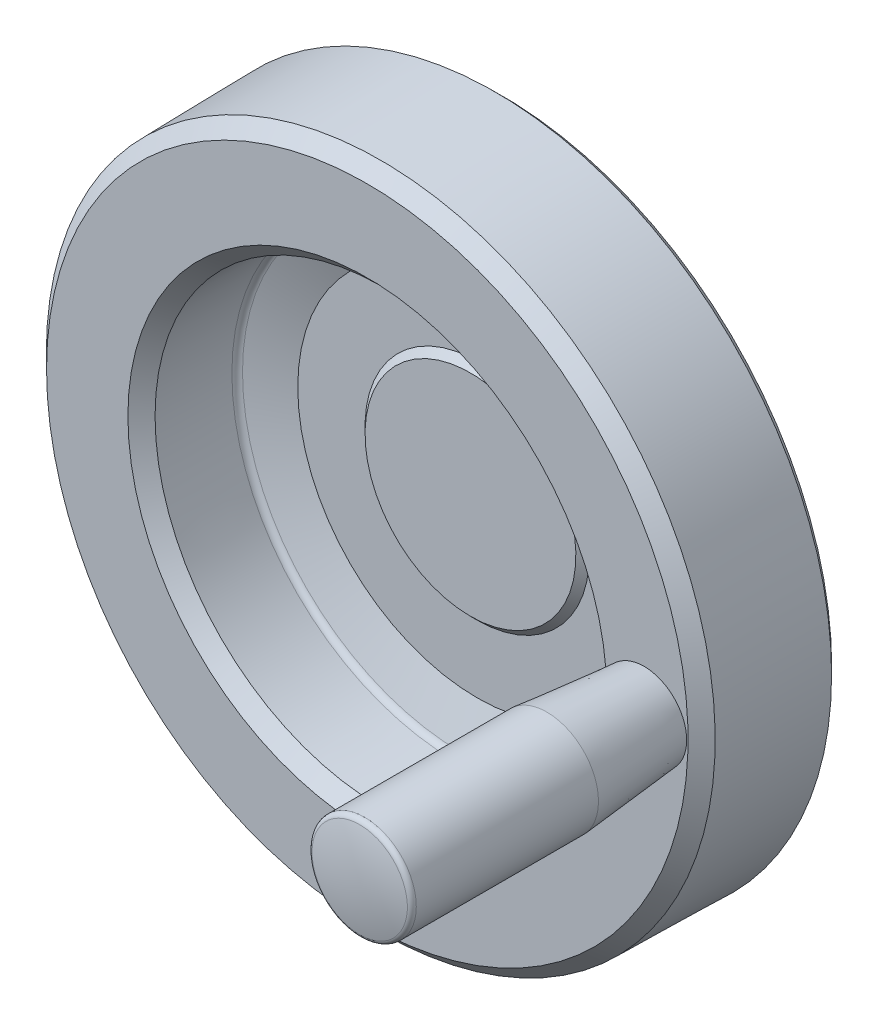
ISO-10303-21;
HEADER;
FILE_DESCRIPTION(('STEP AP214'),'2;1');
FILE_NAME('part.step','',(''),(''),'','','');
FILE_SCHEMA(('AUTOMOTIVE_DESIGN { 1 0 10303 214 1 1 1 1 }'));
ENDSEC;
DATA;
#1=APPLICATION_CONTEXT('core data for automotive mechanical design processes');
#2=APPLICATION_PROTOCOL_DEFINITION('international standard','automotive_design',2000,#1);
#3=PRODUCT_CONTEXT('',#1,'mechanical');
#4=PRODUCT('Part','Part','',(#3));
#5=PRODUCT_RELATED_PRODUCT_CATEGORY('part','',(#4));
#6=PRODUCT_DEFINITION_FORMATION('','',#4);
#7=PRODUCT_DEFINITION_CONTEXT('part definition',#1,'design');
#8=PRODUCT_DEFINITION('design','',#6,#7);
#9=PRODUCT_DEFINITION_SHAPE('','',#8);
#10=(LENGTH_UNIT() NAMED_UNIT(*) SI_UNIT(.MILLI.,.METRE.));
#11=(NAMED_UNIT(*) PLANE_ANGLE_UNIT() SI_UNIT($,.RADIAN.));
#12=(NAMED_UNIT(*) SI_UNIT($,.STERADIAN.) SOLID_ANGLE_UNIT());
#13=UNCERTAINTY_MEASURE_WITH_UNIT(LENGTH_MEASURE(1.E-05),#10,'distance_accuracy_value','');
#14=(GEOMETRIC_REPRESENTATION_CONTEXT(3) GLOBAL_UNCERTAINTY_ASSIGNED_CONTEXT((#13)) GLOBAL_UNIT_ASSIGNED_CONTEXT((#10,
#11,#12)) REPRESENTATION_CONTEXT('',''));
#15=CARTESIAN_POINT('',(0.,0.,0.));
#16=DIRECTION('',(0.,0.,1.));
#17=DIRECTION('',(1.,0.,0.));
#18=AXIS2_PLACEMENT_3D('',#15,#16,#17);
#19=CARTESIAN_POINT('',(62.,0.,46.7669999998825));
#20=DIRECTION('',(0.,0.,1.));
#21=DIRECTION('',(0.,-1.,0.));
#22=AXIS2_PLACEMENT_3D('',#19,#20,#21);
#23=CONICAL_SURFACE('',#22,3.99999999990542,0.785398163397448);
#24=CARTESIAN_POINT('',(62.,0.,46.));
#25=DIRECTION('',(0.,0.,1.));
#26=DIRECTION('',(0.,-1.,0.));
#27=AXIS2_PLACEMENT_3D('',#24,#25,#26);
#28=CIRCLE('',#27,3.23300000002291);
#29=CARTESIAN_POINT('',(62.,-3.23300000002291,46.));
#30=VERTEX_POINT('',#29);
#31=EDGE_CURVE('E132',#30,#30,#28,.T.);
#32=ORIENTED_EDGE('',*,*,#31,.T.);
#33=EDGE_LOOP('',(#32));
#34=FACE_BOUND('',#33,.T.);
#35=CARTESIAN_POINT('',(62.,0.,46.0904999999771));
#36=DIRECTION('',(0.,0.,1.));
#37=DIRECTION('',(0.,1.,0.));
#38=AXIS2_PLACEMENT_3D('',#35,#36,#37);
#39=CIRCLE('',#38,3.3235);
#40=CARTESIAN_POINT('',(62.,3.3235,46.0904999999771));
#41=VERTEX_POINT('',#40);
#42=EDGE_CURVE('E9',#41,#41,#39,.T.);
#43=ORIENTED_EDGE('',*,*,#42,.F.);
#44=EDGE_LOOP('',(#43));
#45=FACE_BOUND('',#44,.T.);
#46=ADVANCED_FACE('F15',(#34,#45),#23,.T.);
#47=CARTESIAN_POINT('',(62.,0.,46.));
#48=DIRECTION('',(0.,0.,1.));
#49=DIRECTION('',(-1.,0.,0.));
#50=AXIS2_PLACEMENT_3D('',#47,#48,#49);
#51=PLANE('',#50);
#52=DIRECTION('',(0.866025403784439,-0.5,0.));
#53=VECTOR('',#52,1.);
#54=CARTESIAN_POINT('',(62.,2.3094010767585,46.));
#55=LINE('',#54,#53);
#56=CARTESIAN_POINT('',(62.,2.3094010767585,46.));
#57=VERTEX_POINT('',#56);
#58=CARTESIAN_POINT('',(64.,1.15470053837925,46.));
#59=VERTEX_POINT('',#58);
#60=EDGE_CURVE('E35',#57,#59,#55,.T.);
#61=ORIENTED_EDGE('',*,*,#60,.F.);
#62=DIRECTION('',(0.866025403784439,0.5,0.));
#63=VECTOR('',#62,1.);
#64=CARTESIAN_POINT('',(60.,1.15470053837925,46.));
#65=LINE('',#64,#63);
#66=CARTESIAN_POINT('',(60.,1.15470053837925,46.));
#67=VERTEX_POINT('',#66);
#68=EDGE_CURVE('E190',#67,#57,#65,.T.);
#69=ORIENTED_EDGE('',*,*,#68,.F.);
#70=DIRECTION('',(0.,-1.,0.));
#71=VECTOR('',#70,1.);
#72=CARTESIAN_POINT('',(60.,0.,46.));
#73=LINE('',#72,#71);
#74=CARTESIAN_POINT('',(60.,-1.15470053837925,46.));
#75=VERTEX_POINT('',#74);
#76=EDGE_CURVE('E188',#75,#67,#73,.F.);
#77=ORIENTED_EDGE('',*,*,#76,.F.);
#78=DIRECTION('',(-0.866025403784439,0.5,0.));
#79=VECTOR('',#78,1.);
#80=CARTESIAN_POINT('',(62.,-2.3094010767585,46.));
#81=LINE('',#80,#79);
#82=CARTESIAN_POINT('',(62.,-2.3094010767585,46.));
#83=VERTEX_POINT('',#82);
#84=EDGE_CURVE('E186',#83,#75,#81,.T.);
#85=ORIENTED_EDGE('',*,*,#84,.F.);
#86=DIRECTION('',(-0.866025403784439,-0.5,0.));
#87=VECTOR('',#86,1.);
#88=CARTESIAN_POINT('',(64.,-1.15470053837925,46.));
#89=LINE('',#88,#87);
#90=CARTESIAN_POINT('',(64.,-1.15470053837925,46.));
#91=VERTEX_POINT('',#90);
#92=EDGE_CURVE('E153',#91,#83,#89,.T.);
#93=ORIENTED_EDGE('',*,*,#92,.F.);
#94=DIRECTION('',(0.,-1.,0.));
#95=VECTOR('',#94,1.);
#96=CARTESIAN_POINT('',(64.,0.,46.));
#97=LINE('',#96,#95);
#98=EDGE_CURVE('E136',#59,#91,#97,.T.);
#99=ORIENTED_EDGE('',*,*,#98,.F.);
#100=EDGE_LOOP('',(#61,#69,#77,#85,#93,#99));
#101=FACE_BOUND('',#100,.T.);
#102=ORIENTED_EDGE('',*,*,#31,.F.);
#103=EDGE_LOOP('',(#102));
#104=FACE_BOUND('',#103,.T.);
#105=ADVANCED_FACE('F229',(#101,#104),#51,.F.);
#106=CARTESIAN_POINT('',(64.,1.15470053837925,49.75));
#107=DIRECTION('',(-0.5,-0.866025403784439,0.));
#108=DIRECTION('',(0.866025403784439,-0.5,0.));
#109=AXIS2_PLACEMENT_3D('',#106,#107,#108);
#110=PLANE('',#109);
#111=DIRECTION('',(-0.866025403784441,0.5,0.));
#112=VECTOR('',#111,1.);
#113=CARTESIAN_POINT('',(63.,1.73205080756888,49.75));
#114=LINE('',#113,#112);
#115=CARTESIAN_POINT('',(63.0000000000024,1.73205080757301,49.7500000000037));
#116=VERTEX_POINT('',#115);
#117=CARTESIAN_POINT('',(62.,2.3094010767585,49.75));
#118=VERTEX_POINT('',#117);
#119=EDGE_CURVE('E97',#116,#118,#114,.T.);
#120=ORIENTED_EDGE('',*,*,#119,.T.);
#121=DIRECTION('',(0.,0.,1.));
#122=VECTOR('',#121,1.);
#123=CARTESIAN_POINT('',(62.,2.3094010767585,49.75));
#124=LINE('',#123,#122);
#125=EDGE_CURVE('E155',#118,#57,#124,.F.);
#126=ORIENTED_EDGE('',*,*,#125,.T.);
#127=ORIENTED_EDGE('',*,*,#60,.T.);
#128=DIRECTION('',(0.,0.,-1.));
#129=VECTOR('',#128,1.);
#130=CARTESIAN_POINT('',(64.,1.15470053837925,49.75));
#131=LINE('',#130,#129);
#132=CARTESIAN_POINT('',(64.,1.15470053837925,49.75));
#133=VERTEX_POINT('',#132);
#134=EDGE_CURVE('E99',#133,#59,#131,.T.);
#135=ORIENTED_EDGE('',*,*,#134,.F.);
#136=DIRECTION('',(-0.866025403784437,0.5,0.));
#137=VECTOR('',#136,1.);
#138=CARTESIAN_POINT('',(64.,1.15470053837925,49.75));
#139=LINE('',#138,#137);
#140=EDGE_CURVE('E93',#133,#116,#139,.T.);
#141=ORIENTED_EDGE('',*,*,#140,.T.);
#142=EDGE_LOOP('',(#120,#126,#127,#135,#141));
#143=FACE_BOUND('',#142,.T.);
#144=ADVANCED_FACE('F95',(#143),#110,.T.);
#145=CARTESIAN_POINT('',(62.,2.3094010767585,49.75));
#146=DIRECTION('',(0.5,-0.866025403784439,0.));
#147=DIRECTION('',(0.866025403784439,0.5,0.));
#148=AXIS2_PLACEMENT_3D('',#145,#146,#147);
#149=PLANE('',#148);
#150=DIRECTION('',(-0.866025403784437,-0.5,0.));
#151=VECTOR('',#150,1.);
#152=CARTESIAN_POINT('',(61.,1.73205080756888,49.75));
#153=LINE('',#152,#151);
#154=CARTESIAN_POINT('',(60.9999999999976,1.73205080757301,49.7500000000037));
#155=VERTEX_POINT('',#154);
#156=CARTESIAN_POINT('',(60.,1.15470053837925,49.75));
#157=VERTEX_POINT('',#156);
#158=EDGE_CURVE('E167',#155,#157,#153,.T.);
#159=ORIENTED_EDGE('',*,*,#158,.T.);
#160=DIRECTION('',(0.,0.,1.));
#161=VECTOR('',#160,1.);
#162=CARTESIAN_POINT('',(60.,1.15470053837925,49.75));
#163=LINE('',#162,#161);
#164=EDGE_CURVE('E157',#157,#67,#163,.F.);
#165=ORIENTED_EDGE('',*,*,#164,.T.);
#166=ORIENTED_EDGE('',*,*,#68,.T.);
#167=ORIENTED_EDGE('',*,*,#125,.F.);
#168=DIRECTION('',(-0.866025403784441,-0.5,0.));
#169=VECTOR('',#168,1.);
#170=CARTESIAN_POINT('',(62.,2.3094010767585,49.75));
#171=LINE('',#170,#169);
#172=EDGE_CURVE('E114',#118,#155,#171,.T.);
#173=ORIENTED_EDGE('',*,*,#172,.T.);
#174=EDGE_LOOP('',(#159,#165,#166,#167,#173));
#175=FACE_BOUND('',#174,.T.);
#176=ADVANCED_FACE('F240',(#175),#149,.T.);
#177=CARTESIAN_POINT('',(60.,1.15470053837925,49.75));
#178=DIRECTION('',(1.,0.,0.));
#179=DIRECTION('',(0.,0.,1.));
#180=AXIS2_PLACEMENT_3D('',#177,#178,#179);
#181=PLANE('',#180);
#182=DIRECTION('',(0.,-1.,0.));
#183=VECTOR('',#182,1.);
#184=CARTESIAN_POINT('',(60.,0.,49.75));
#185=LINE('',#184,#183);
#186=CARTESIAN_POINT('',(59.9999999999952,0.,49.7500000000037));
#187=VERTEX_POINT('',#186);
#188=CARTESIAN_POINT('',(60.,-1.15470053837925,49.75));
#189=VERTEX_POINT('',#188);
#190=EDGE_CURVE('E171',#187,#189,#185,.T.);
#191=ORIENTED_EDGE('',*,*,#190,.T.);
#192=DIRECTION('',(0.,0.,1.));
#193=VECTOR('',#192,1.);
#194=CARTESIAN_POINT('',(60.,-1.15470053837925,49.75));
#195=LINE('',#194,#193);
#196=EDGE_CURVE('E160',#189,#75,#195,.F.);
#197=ORIENTED_EDGE('',*,*,#196,.T.);
#198=ORIENTED_EDGE('',*,*,#76,.T.);
#199=ORIENTED_EDGE('',*,*,#164,.F.);
#200=DIRECTION('',(0.,-1.,0.));
#201=VECTOR('',#200,1.);
#202=CARTESIAN_POINT('',(60.,0.,49.75));
#203=LINE('',#202,#201);
#204=EDGE_CURVE('E169',#157,#187,#203,.T.);
#205=ORIENTED_EDGE('',*,*,#204,.T.);
#206=EDGE_LOOP('',(#191,#197,#198,#199,#205));
#207=FACE_BOUND('',#206,.T.);
#208=ADVANCED_FACE('F243',(#207),#181,.T.);
#209=CARTESIAN_POINT('',(60.,-1.15470053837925,49.75));
#210=DIRECTION('',(0.5,0.866025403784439,0.));
#211=DIRECTION('',(-0.866025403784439,0.5,0.));
#212=AXIS2_PLACEMENT_3D('',#209,#210,#211);
#213=PLANE('',#212);
#214=DIRECTION('',(-0.866025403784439,0.5,0.));
#215=VECTOR('',#214,1.);
#216=CARTESIAN_POINT('',(60.,-1.15470053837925,49.75));
#217=LINE('',#216,#215);
#218=CARTESIAN_POINT('',(60.9999999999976,-1.73205080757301,49.7500000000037));
#219=VERTEX_POINT('',#218);
#220=CARTESIAN_POINT('',(62.,-2.30940107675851,49.75));
#221=VERTEX_POINT('',#220);
#222=EDGE_CURVE('E180',#219,#221,#217,.F.);
#223=ORIENTED_EDGE('',*,*,#222,.T.);
#224=DIRECTION('',(0.,0.,1.));
#225=VECTOR('',#224,1.);
#226=CARTESIAN_POINT('',(62.,-2.30940107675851,49.75));
#227=LINE('',#226,#225);
#228=EDGE_CURVE('E163',#221,#83,#227,.F.);
#229=ORIENTED_EDGE('',*,*,#228,.T.);
#230=ORIENTED_EDGE('',*,*,#84,.T.);
#231=ORIENTED_EDGE('',*,*,#196,.F.);
#232=DIRECTION('',(0.866025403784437,-0.5,0.));
#233=VECTOR('',#232,1.);
#234=CARTESIAN_POINT('',(60.,-1.15470053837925,49.75));
#235=LINE('',#234,#233);
#236=EDGE_CURVE('E173',#189,#219,#235,.T.);
#237=ORIENTED_EDGE('',*,*,#236,.T.);
#238=EDGE_LOOP('',(#223,#229,#230,#231,#237));
#239=FACE_BOUND('',#238,.T.);
#240=ADVANCED_FACE('F247',(#239),#213,.T.);
#241=CARTESIAN_POINT('',(62.,-2.3094010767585,49.75));
#242=DIRECTION('',(-0.5,0.866025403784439,0.));
#243=DIRECTION('',(-0.866025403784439,-0.5,0.));
#244=AXIS2_PLACEMENT_3D('',#241,#242,#243);
#245=PLANE('',#244);
#246=DIRECTION('',(0.866025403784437,0.5,0.));
#247=VECTOR('',#246,1.);
#248=CARTESIAN_POINT('',(63.,-1.73205080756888,49.75));
#249=LINE('',#248,#247);
#250=CARTESIAN_POINT('',(63.0000000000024,-1.73205080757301,49.7500000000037));
#251=VERTEX_POINT('',#250);
#252=CARTESIAN_POINT('',(64.,-1.15470053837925,49.75));
#253=VERTEX_POINT('',#252);
#254=EDGE_CURVE('E175',#251,#253,#249,.T.);
#255=ORIENTED_EDGE('',*,*,#254,.T.);
#256=DIRECTION('',(0.,0.,-1.));
#257=VECTOR('',#256,1.);
#258=CARTESIAN_POINT('',(64.,-1.15470053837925,49.75));
#259=LINE('',#258,#257);
#260=EDGE_CURVE('E154',#91,#253,#259,.F.);
#261=ORIENTED_EDGE('',*,*,#260,.F.);
#262=ORIENTED_EDGE('',*,*,#92,.T.);
#263=ORIENTED_EDGE('',*,*,#228,.F.);
#264=DIRECTION('',(-0.866025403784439,-0.5,0.));
#265=VECTOR('',#264,1.);
#266=CARTESIAN_POINT('',(62.,-2.3094010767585,49.75));
#267=LINE('',#266,#265);
#268=EDGE_CURVE('E131',#221,#251,#267,.F.);
#269=ORIENTED_EDGE('',*,*,#268,.T.);
#270=EDGE_LOOP('',(#255,#261,#262,#263,#269));
#271=FACE_BOUND('',#270,.T.);
#272=ADVANCED_FACE('F237',(#271),#245,.T.);
#273=CARTESIAN_POINT('',(64.,-1.15470053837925,49.75));
#274=DIRECTION('',(-1.,0.,0.));
#275=DIRECTION('',(0.,0.,-1.));
#276=AXIS2_PLACEMENT_3D('',#273,#274,#275);
#277=PLANE('',#276);
#278=DIRECTION('',(0.,-1.,0.));
#279=VECTOR('',#278,1.);
#280=CARTESIAN_POINT('',(64.,0.,49.75));
#281=LINE('',#280,#279);
#282=CARTESIAN_POINT('',(64.0000000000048,0.,49.7500000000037));
#283=VERTEX_POINT('',#282);
#284=EDGE_CURVE('E101',#283,#133,#281,.F.);
#285=ORIENTED_EDGE('',*,*,#284,.T.);
#286=ORIENTED_EDGE('',*,*,#134,.T.);
#287=ORIENTED_EDGE('',*,*,#98,.T.);
#288=ORIENTED_EDGE('',*,*,#260,.T.);
#289=DIRECTION('',(0.,-1.,0.));
#290=VECTOR('',#289,1.);
#291=CARTESIAN_POINT('',(64.,0.,49.75));
#292=LINE('',#291,#290);
#293=EDGE_CURVE('E89',#253,#283,#292,.F.);
#294=ORIENTED_EDGE('',*,*,#293,.T.);
#295=EDGE_LOOP('',(#285,#286,#287,#288,#294));
#296=FACE_BOUND('',#295,.T.);
#297=ADVANCED_FACE('F234',(#296),#277,.T.);
#298=CARTESIAN_POINT('',(62.,0.,49.75));
#299=DIRECTION('',(0.,0.,1.));
#300=DIRECTION('',(-1.,0.,0.));
#301=AXIS2_PLACEMENT_3D('',#298,#299,#300);
#302=PLANE('',#301);
#303=ORIENTED_EDGE('',*,*,#172,.F.);
#304=ORIENTED_EDGE('',*,*,#119,.F.);
#305=CARTESIAN_POINT('',(62.,0.,49.7500000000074));
#306=DIRECTION('',(0.,0.,-1.));
#307=DIRECTION('',(1.,0.,0.));
#308=AXIS2_PLACEMENT_3D('',#305,#306,#307);
#309=CIRCLE('',#308,2.00000000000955);
#310=EDGE_CURVE('E108',#116,#155,#309,.F.);
#311=ORIENTED_EDGE('',*,*,#310,.T.);
#312=EDGE_LOOP('',(#303,#304,#311));
#313=FACE_BOUND('',#312,.T.);
#314=ADVANCED_FACE('F112',(#313),#302,.F.);
#315=CARTESIAN_POINT('',(62.,0.,49.75));
#316=DIRECTION('',(0.,0.,1.));
#317=DIRECTION('',(-1.,0.,0.));
#318=AXIS2_PLACEMENT_3D('',#315,#316,#317);
#319=PLANE('',#318);
#320=ORIENTED_EDGE('',*,*,#140,.F.);
#321=ORIENTED_EDGE('',*,*,#284,.F.);
#322=CARTESIAN_POINT('',(62.,0.,49.7500000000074));
#323=DIRECTION('',(0.,0.,-1.));
#324=DIRECTION('',(1.,0.,0.));
#325=AXIS2_PLACEMENT_3D('',#322,#323,#324);
#326=CIRCLE('',#325,2.00000000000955);
#327=EDGE_CURVE('E19',#283,#116,#326,.F.);
#328=ORIENTED_EDGE('',*,*,#327,.T.);
#329=EDGE_LOOP('',(#320,#321,#328));
#330=FACE_BOUND('',#329,.T.);
#331=ADVANCED_FACE('F17',(#330),#319,.F.);
#332=CARTESIAN_POINT('',(62.,0.,49.75));
#333=DIRECTION('',(0.,0.,1.));
#334=DIRECTION('',(-1.,0.,0.));
#335=AXIS2_PLACEMENT_3D('',#332,#333,#334);
#336=PLANE('',#335);
#337=ORIENTED_EDGE('',*,*,#204,.F.);
#338=ORIENTED_EDGE('',*,*,#158,.F.);
#339=CARTESIAN_POINT('',(62.,0.,49.7500000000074));
#340=DIRECTION('',(0.,0.,-1.));
#341=DIRECTION('',(1.,0.,0.));
#342=AXIS2_PLACEMENT_3D('',#339,#340,#341);
#343=CIRCLE('',#342,2.00000000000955);
#344=EDGE_CURVE('E121',#155,#187,#343,.F.);
#345=ORIENTED_EDGE('',*,*,#344,.T.);
#346=EDGE_LOOP('',(#337,#338,#345));
#347=FACE_BOUND('',#346,.T.);
#348=ADVANCED_FACE('F269',(#347),#336,.F.);
#349=CARTESIAN_POINT('',(62.,0.,49.75));
#350=DIRECTION('',(0.,0.,1.));
#351=DIRECTION('',(-1.,0.,0.));
#352=AXIS2_PLACEMENT_3D('',#349,#350,#351);
#353=PLANE('',#352);
#354=ORIENTED_EDGE('',*,*,#236,.F.);
#355=ORIENTED_EDGE('',*,*,#190,.F.);
#356=CARTESIAN_POINT('',(62.,0.,49.7500000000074));
#357=DIRECTION('',(0.,0.,-1.));
#358=DIRECTION('',(1.,0.,0.));
#359=AXIS2_PLACEMENT_3D('',#356,#357,#358);
#360=CIRCLE('',#359,2.00000000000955);
#361=EDGE_CURVE('E122',#187,#219,#360,.F.);
#362=ORIENTED_EDGE('',*,*,#361,.T.);
#363=EDGE_LOOP('',(#354,#355,#362));
#364=FACE_BOUND('',#363,.T.);
#365=ADVANCED_FACE('F259',(#364),#353,.F.);
#366=CARTESIAN_POINT('',(62.,0.,49.75));
#367=DIRECTION('',(0.,0.,1.));
#368=DIRECTION('',(-1.,0.,0.));
#369=AXIS2_PLACEMENT_3D('',#366,#367,#368);
#370=PLANE('',#369);
#371=ORIENTED_EDGE('',*,*,#268,.F.);
#372=ORIENTED_EDGE('',*,*,#222,.F.);
#373=CARTESIAN_POINT('',(62.,0.,49.7500000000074));
#374=DIRECTION('',(0.,0.,-1.));
#375=DIRECTION('',(1.,0.,0.));
#376=AXIS2_PLACEMENT_3D('',#373,#374,#375);
#377=CIRCLE('',#376,2.00000000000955);
#378=EDGE_CURVE('E129',#251,#219,#377,.T.);
#379=ORIENTED_EDGE('',*,*,#378,.F.);
#380=EDGE_LOOP('',(#371,#372,#379));
#381=FACE_BOUND('',#380,.T.);
#382=ADVANCED_FACE('F255',(#381),#370,.F.);
#383=CARTESIAN_POINT('',(62.,0.,49.75));
#384=DIRECTION('',(0.,0.,1.));
#385=DIRECTION('',(-1.,0.,0.));
#386=AXIS2_PLACEMENT_3D('',#383,#384,#385);
#387=PLANE('',#386);
#388=ORIENTED_EDGE('',*,*,#293,.F.);
#389=ORIENTED_EDGE('',*,*,#254,.F.);
#390=CARTESIAN_POINT('',(62.,0.,49.7500000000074));
#391=DIRECTION('',(0.,0.,-1.));
#392=DIRECTION('',(1.,0.,0.));
#393=AXIS2_PLACEMENT_3D('',#390,#391,#392);
#394=CIRCLE('',#393,2.00000000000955);
#395=EDGE_CURVE('E127',#251,#283,#394,.F.);
#396=ORIENTED_EDGE('',*,*,#395,.T.);
#397=EDGE_LOOP('',(#388,#389,#396));
#398=FACE_BOUND('',#397,.T.);
#399=ADVANCED_FACE('F258',(#398),#387,.F.);
#400=CARTESIAN_POINT('',(62.,0.,49.7500000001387));
#401=DIRECTION('',(0.,0.,-1.));
#402=DIRECTION('',(1.,0.,0.));
#403=AXIS2_PLACEMENT_3D('',#400,#401,#402);
#404=CONICAL_SURFACE('',#403,1.99999999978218,1.04719755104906);
#405=CARTESIAN_POINT('',(61.9999999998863,0.,50.904700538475));
#406=VERTEX_POINT('',#405);
#407=VERTEX_LOOP('',#406);
#408=FACE_BOUND('',#407,.T.);
#409=ORIENTED_EDGE('',*,*,#378,.T.);
#410=ORIENTED_EDGE('',*,*,#361,.F.);
#411=ORIENTED_EDGE('',*,*,#344,.F.);
#412=ORIENTED_EDGE('',*,*,#310,.F.);
#413=ORIENTED_EDGE('',*,*,#327,.F.);
#414=ORIENTED_EDGE('',*,*,#395,.F.);
#415=EDGE_LOOP('',(#409,#410,#411,#412,#413,#414));
#416=FACE_BOUND('',#415,.T.);
#417=ADVANCED_FACE('F118',(#408,#416),#404,.F.);
#418=CARTESIAN_POINT('',(62.,0.,126.));
#419=DIRECTION('',(0.,0.,-1.));
#420=DIRECTION('',(1.,0.,0.));
#421=AXIS2_PLACEMENT_3D('',#418,#419,#420);
#422=CYLINDRICAL_SURFACE('',#421,5.2);
#423=CARTESIAN_POINT('',(62.,0.,61.));
#424=DIRECTION('',(0.,0.,-1.));
#425=DIRECTION('',(0.,-1.,0.));
#426=AXIS2_PLACEMENT_3D('',#423,#424,#425);
#427=CIRCLE('',#426,5.2);
#428=CARTESIAN_POINT('',(62.,-5.2,61.));
#429=VERTEX_POINT('',#428);
#430=EDGE_CURVE('E329',#429,#429,#427,.T.);
#431=ORIENTED_EDGE('',*,*,#430,.F.);
#432=EDGE_LOOP('',(#431));
#433=FACE_BOUND('',#432,.T.);
#434=CARTESIAN_POINT('',(62.,0.,61.3));
#435=DIRECTION('',(0.,0.,-1.));
#436=DIRECTION('',(1.,0.,0.));
#437=AXIS2_PLACEMENT_3D('',#434,#435,#436);
#438=CIRCLE('',#437,5.2);
#439=CARTESIAN_POINT('',(67.2,0.,61.3));
#440=VERTEX_POINT('',#439);
#441=EDGE_CURVE('E142',#440,#440,#438,.T.);
#442=ORIENTED_EDGE('',*,*,#441,.T.);
#443=EDGE_LOOP('',(#442));
#444=FACE_BOUND('',#443,.T.);
#445=ADVANCED_FACE('F207',(#433,#444),#422,.T.);
#446=CARTESIAN_POINT('',(62.,-5.2,61.3));
#447=DIRECTION('',(0.,0.,1.));
#448=DIRECTION('',(-1.,0.,0.));
#449=AXIS2_PLACEMENT_3D('',#446,#447,#448);
#450=PLANE('',#449);
#451=ORIENTED_EDGE('',*,*,#441,.F.);
#452=EDGE_LOOP('',(#451));
#453=FACE_BOUND('',#452,.T.);
#454=CARTESIAN_POINT('',(62.,0.,61.3));
#455=DIRECTION('',(0.,0.,1.));
#456=DIRECTION('',(-1.,0.,0.));
#457=AXIS2_PLACEMENT_3D('',#454,#455,#456);
#458=CIRCLE('',#457,9.5);
#459=CARTESIAN_POINT('',(52.5,0.,61.3));
#460=VERTEX_POINT('',#459);
#461=EDGE_CURVE('E148',#460,#460,#458,.T.);
#462=ORIENTED_EDGE('',*,*,#461,.F.);
#463=EDGE_LOOP('',(#462));
#464=FACE_BOUND('',#463,.T.);
#465=ADVANCED_FACE('F208',(#453,#464),#450,.F.);
#466=CARTESIAN_POINT('',(62.,0.,82.9666666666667));
#467=DIRECTION('',(0.,0.,1.));
#468=DIRECTION('',(-1.,0.,0.));
#469=AXIS2_PLACEMENT_3D('',#466,#467,#468);
#470=CONICAL_SURFACE('',#469,11.5,0.0920468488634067);
#471=ORIENTED_EDGE('',*,*,#461,.T.);
#472=EDGE_LOOP('',(#471));
#473=FACE_BOUND('',#472,.T.);
#474=CARTESIAN_POINT('',(62.,0.,82.9666666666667));
#475=DIRECTION('',(0.,0.,-1.));
#476=DIRECTION('',(1.,0.,0.));
#477=AXIS2_PLACEMENT_3D('',#474,#475,#476);
#478=CIRCLE('',#477,11.5);
#479=CARTESIAN_POINT('',(73.5,0.,82.9666666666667));
#480=VERTEX_POINT('',#479);
#481=EDGE_CURVE('E315',#480,#480,#478,.F.);
#482=ORIENTED_EDGE('',*,*,#481,.F.);
#483=EDGE_LOOP('',(#482));
#484=FACE_BOUND('',#483,.T.);
#485=ADVANCED_FACE('F296',(#473,#484),#470,.T.);
#486=CARTESIAN_POINT('',(62.,0.,126.));
#487=DIRECTION('',(0.,0.,-1.));
#488=DIRECTION('',(1.,0.,0.));
#489=AXIS2_PLACEMENT_3D('',#486,#487,#488);
#490=CYLINDRICAL_SURFACE('',#489,11.5);
#491=ORIENTED_EDGE('',*,*,#481,.T.);
#492=EDGE_LOOP('',(#491));
#493=FACE_BOUND('',#492,.T.);
#494=CARTESIAN_POINT('',(62.,0.,123.577931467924));
#495=DIRECTION('',(0.,0.,-1.));
#496=DIRECTION('',(1.,0.,0.));
#497=AXIS2_PLACEMENT_3D('',#494,#495,#496);
#498=CIRCLE('',#497,11.5);
#499=CARTESIAN_POINT('',(73.5,0.,123.577931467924));
#500=VERTEX_POINT('',#499);
#501=EDGE_CURVE('E151',#500,#500,#498,.T.);
#502=ORIENTED_EDGE('',*,*,#501,.T.);
#503=EDGE_LOOP('',(#502));
#504=FACE_BOUND('',#503,.T.);
#505=ADVANCED_FACE('F293',(#493,#504),#490,.T.);
#506=CARTESIAN_POINT('',(62.,0.,123.577931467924));
#507=DIRECTION('',(0.,0.,1.));
#508=DIRECTION('',(-1.,0.,0.));
#509=AXIS2_PLACEMENT_3D('',#506,#507,#508);
#510=TOROIDAL_SURFACE('',#509,10.35,1.15);
#511=CARTESIAN_POINT('',(62.,0.,124.693705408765));
#512=DIRECTION('',(0.,0.,1.));
#513=DIRECTION('',(-1.,0.,0.));
#514=AXIS2_PLACEMENT_3D('',#511,#512,#513);
#515=CIRCLE('',#514,10.6284753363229);
#516=CARTESIAN_POINT('',(51.3715246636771,0.,124.693705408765));
#517=VERTEX_POINT('',#516);
#518=EDGE_CURVE('E145',#517,#517,#515,.F.);
#519=ORIENTED_EDGE('',*,*,#518,.T.);
#520=EDGE_LOOP('',(#519));
#521=FACE_BOUND('',#520,.T.);
#522=ORIENTED_EDGE('',*,*,#501,.F.);
#523=EDGE_LOOP('',(#522));
#524=FACE_BOUND('',#523,.T.);
#525=ADVANCED_FACE('F205',(#521,#524),#510,.T.);
#526=CARTESIAN_POINT('',(62.,0.,82.1083333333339));
#527=DIRECTION('',(0.,1.,0.));
#528=DIRECTION('',(-1.,0.,0.));
#529=AXIS2_PLACEMENT_3D('',#526,#527,#528);
#530=SPHERICAL_SURFACE('',#529,43.8916666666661);
#531=ORIENTED_EDGE('',*,*,#518,.F.);
#532=EDGE_LOOP('',(#531));
#533=FACE_BOUND('',#532,.T.);
#534=ADVANCED_FACE('F200',(#533),#530,.T.);
#535=CARTESIAN_POINT('',(62.,0.,31.));
#536=DIRECTION('',(0.,0.,1.));
#537=DIRECTION('',(0.,1.,0.));
#538=AXIS2_PLACEMENT_3D('',#535,#536,#537);
#539=CYLINDRICAL_SURFACE('',#538,3.3235);
#540=ORIENTED_EDGE('',*,*,#42,.T.);
#541=EDGE_LOOP('',(#540));
#542=FACE_BOUND('',#541,.T.);
#543=CARTESIAN_POINT('',(62.,0.,31.6765000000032));
#544=DIRECTION('',(0.,0.,-1.));
#545=DIRECTION('',(0.,-1.,0.));
#546=AXIS2_PLACEMENT_3D('',#543,#544,#545);
#547=CIRCLE('',#546,3.3235000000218);
#548=CARTESIAN_POINT('',(62.,-3.3235000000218,31.6765000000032));
#549=VERTEX_POINT('',#548);
#550=EDGE_CURVE('E803',#549,#549,#547,.T.);
#551=ORIENTED_EDGE('',*,*,#550,.T.);
#552=EDGE_LOOP('',(#551));
#553=FACE_BOUND('',#552,.T.);
#554=ADVANCED_FACE('F204',(#542,#553),#539,.F.);
#555=CARTESIAN_POINT('',(62.,0.,31.0000000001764));
#556=DIRECTION('',(0.,0.,-1.));
#557=DIRECTION('',(0.,-1.,0.));
#558=AXIS2_PLACEMENT_3D('',#555,#556,#557);
#559=CONICAL_SURFACE('',#558,3.99999999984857,0.785398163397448);
#560=ORIENTED_EDGE('',*,*,#550,.F.);
#561=EDGE_LOOP('',(#560));
#562=FACE_BOUND('',#561,.T.);
#563=CARTESIAN_POINT('',(62.,0.,31.0000000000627));
#564=DIRECTION('',(0.,0.,-1.));
#565=DIRECTION('',(0.,-1.,0.));
#566=AXIS2_PLACEMENT_3D('',#563,#564,#565);
#567=CIRCLE('',#566,3.99999999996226);
#568=CARTESIAN_POINT('',(62.,-3.99999999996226,31.0000000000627));
#569=VERTEX_POINT('',#568);
#570=EDGE_CURVE('E353',#569,#569,#567,.T.);
#571=ORIENTED_EDGE('',*,*,#570,.T.);
#572=EDGE_LOOP('',(#571));
#573=FACE_BOUND('',#572,.T.);
#574=ADVANCED_FACE('F482',(#562,#573),#559,.F.);
#575=CARTESIAN_POINT('',(-73.5261825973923,0.,31.));
#576=DIRECTION('',(0.,0.,1.));
#577=DIRECTION('',(0.,1.,0.));
#578=AXIS2_PLACEMENT_3D('',#575,#576,#577);
#579=PLANE('',#578);
#580=CARTESIAN_POINT('',(0.,0.,31.));
#581=DIRECTION('',(0.,0.,1.));
#582=DIRECTION('',(1.,0.,0.));
#583=AXIS2_PLACEMENT_3D('',#580,#581,#582);
#584=CIRCLE('',#583,73.5261825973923);
#585=CARTESIAN_POINT('',(73.5261825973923,0.,31.));
#586=VERTEX_POINT('',#585);
#587=EDGE_CURVE('E363',#586,#586,#584,.T.);
#588=ORIENTED_EDGE('',*,*,#587,.F.);
#589=EDGE_LOOP('',(#588));
#590=FACE_BOUND('',#589,.T.);
#591=ORIENTED_EDGE('',*,*,#570,.F.);
#592=EDGE_LOOP('',(#591));
#593=FACE_BOUND('',#592,.T.);
#594=CARTESIAN_POINT('',(0.,0.,31.));
#595=DIRECTION('',(0.,0.,1.));
#596=DIRECTION('',(0.,1.,0.));
#597=AXIS2_PLACEMENT_3D('',#594,#595,#596);
#598=CIRCLE('',#597,50.);
#599=CARTESIAN_POINT('',(0.,50.,31.));
#600=VERTEX_POINT('',#599);
#601=EDGE_CURVE('E350',#600,#600,#598,.F.);
#602=ORIENTED_EDGE('',*,*,#601,.F.);
#603=EDGE_LOOP('',(#602));
#604=FACE_BOUND('',#603,.T.);
#605=ADVANCED_FACE('F485',(#590,#593,#604),#579,.F.);
#606=CARTESIAN_POINT('',(-53.3641178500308,0.,61.));
#607=DIRECTION('',(0.,0.,-1.));
#608=DIRECTION('',(0.,-1.,0.));
#609=AXIS2_PLACEMENT_3D('',#606,#607,#608);
#610=PLANE('',#609);
#611=ORIENTED_EDGE('',*,*,#430,.T.);
#612=EDGE_LOOP('',(#611));
#613=FACE_BOUND('',#612,.T.);
#614=CARTESIAN_POINT('',(0.,0.,61.));
#615=DIRECTION('',(0.,0.,1.));
#616=DIRECTION('',(1.,0.,0.));
#617=AXIS2_PLACEMENT_3D('',#614,#615,#616);
#618=CIRCLE('',#617,53.3641178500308);
#619=CARTESIAN_POINT('',(53.3641178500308,0.,61.));
#620=VERTEX_POINT('',#619);
#621=EDGE_CURVE('E360',#620,#620,#618,.T.);
#622=ORIENTED_EDGE('',*,*,#621,.F.);
#623=EDGE_LOOP('',(#622));
#624=FACE_BOUND('',#623,.T.);
#625=CARTESIAN_POINT('',(0.,0.,61.));
#626=DIRECTION('',(0.,0.,-1.));
#627=DIRECTION('',(-1.,0.,0.));
#628=AXIS2_PLACEMENT_3D('',#625,#626,#627);
#629=CIRCLE('',#628,71.5025306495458);
#630=CARTESIAN_POINT('',(-71.5025306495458,0.,61.));
#631=VERTEX_POINT('',#630);
#632=EDGE_CURVE('E366',#631,#631,#629,.T.);
#633=ORIENTED_EDGE('',*,*,#632,.F.);
#634=EDGE_LOOP('',(#633));
#635=FACE_BOUND('',#634,.T.);
#636=ADVANCED_FACE('F634',(#613,#624,#635),#610,.F.);
#637=CARTESIAN_POINT('',(0.,0.,61.));
#638=DIRECTION('',(0.,0.,1.));
#639=DIRECTION('',(1.,0.,0.));
#640=AXIS2_PLACEMENT_3D('',#637,#638,#639);
#641=CONICAL_SURFACE('',#640,53.3641178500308,0.794124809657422);
#642=CARTESIAN_POINT('',(0.,0.,58.0004569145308));
#643=DIRECTION('',(0.,0.,1.));
#644=DIRECTION('',(0.,1.,0.));
#645=AXIS2_PLACEMENT_3D('',#642,#643,#644);
#646=CIRCLE('',#645,50.3117606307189);
#647=CARTESIAN_POINT('',(0.,50.3117606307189,58.0004569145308));
#648=VERTEX_POINT('',#647);
#649=EDGE_CURVE('E354',#648,#648,#646,.T.);
#650=ORIENTED_EDGE('',*,*,#649,.F.);
#651=EDGE_LOOP('',(#650));
#652=FACE_BOUND('',#651,.T.);
#653=ORIENTED_EDGE('',*,*,#621,.T.);
#654=EDGE_LOOP('',(#653));
#655=FACE_BOUND('',#654,.T.);
#656=ADVANCED_FACE('F480',(#652,#655),#641,.F.);
#657=CARTESIAN_POINT('',(0.,0.,58.0004569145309));
#658=DIRECTION('',(0.,0.,-1.));
#659=DIRECTION('',(-1.,0.,0.));
#660=AXIS2_PLACEMENT_3D('',#657,#658,#659);
#661=CONICAL_SURFACE('',#660,74.5548878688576,0.794124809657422);
#662=ORIENTED_EDGE('',*,*,#632,.T.);
#663=EDGE_LOOP('',(#662));
#664=FACE_BOUND('',#663,.T.);
#665=CARTESIAN_POINT('',(0.,0.,58.0004569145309));
#666=DIRECTION('',(0.,0.,-1.));
#667=DIRECTION('',(0.,-1.,0.));
#668=AXIS2_PLACEMENT_3D('',#665,#666,#667);
#669=CIRCLE('',#668,74.5548878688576);
#670=CARTESIAN_POINT('',(0.,-74.5548878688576,58.0004569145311));
#671=VERTEX_POINT('',#670);
#672=EDGE_CURVE('E331',#671,#671,#669,.T.);
#673=ORIENTED_EDGE('',*,*,#672,.F.);
#674=EDGE_LOOP('',(#673));
#675=FACE_BOUND('',#674,.T.);
#676=ADVANCED_FACE('F495',(#664,#675),#661,.T.);
#677=CARTESIAN_POINT('',(0.,0.,58.0004569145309));
#678=DIRECTION('',(0.,0.,1.));
#679=DIRECTION('',(1.,0.,0.));
#680=AXIS2_PLACEMENT_3D('',#677,#678,#679);
#681=CONICAL_SURFACE('',#680,50.311760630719,0.0174532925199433);
#682=CARTESIAN_POINT('',(0.,0.,41.170466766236));
#683=DIRECTION('',(0.,0.,1.));
#684=DIRECTION('',(0.,1.,0.));
#685=AXIS2_PLACEMENT_3D('',#682,#683,#684);
#686=CIRCLE('',#685,50.0179920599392);
#687=CARTESIAN_POINT('',(0.,50.0179920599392,41.170466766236));
#688=VERTEX_POINT('',#687);
#689=EDGE_CURVE('E514',#688,#688,#686,.T.);
#690=ORIENTED_EDGE('',*,*,#689,.F.);
#691=EDGE_LOOP('',(#690));
#692=FACE_BOUND('',#691,.T.);
#693=ORIENTED_EDGE('',*,*,#649,.T.);
#694=EDGE_LOOP('',(#693));
#695=FACE_BOUND('',#694,.T.);
#696=ADVANCED_FACE('F492',(#692,#695),#681,.F.);
#697=CARTESIAN_POINT('',(0.,0.,32.4997715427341));
#698=DIRECTION('',(0.,0.,-1.));
#699=DIRECTION('',(0.,-1.,0.));
#700=AXIS2_PLACEMENT_3D('',#697,#698,#699);
#701=CONICAL_SURFACE('',#700,75.0000039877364,0.0174532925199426);
#702=ORIENTED_EDGE('',*,*,#672,.T.);
#703=EDGE_LOOP('',(#702));
#704=FACE_BOUND('',#703,.T.);
#705=CARTESIAN_POINT('',(0.,0.,32.4997715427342));
#706=DIRECTION('',(0.,0.,-1.));
#707=DIRECTION('',(0.,-1.,0.));
#708=AXIS2_PLACEMENT_3D('',#705,#706,#707);
#709=CIRCLE('',#708,75.0000039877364);
#710=CARTESIAN_POINT('',(0.,-75.0000039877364,32.4997715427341));
#711=VERTEX_POINT('',#710);
#712=EDGE_CURVE('E369',#711,#711,#709,.F.);
#713=ORIENTED_EDGE('',*,*,#712,.T.);
#714=EDGE_LOOP('',(#713));
#715=FACE_BOUND('',#714,.T.);
#716=ADVANCED_FACE('F494',(#704,#715),#701,.T.);
#717=CARTESIAN_POINT('',(0.,0.,41.196645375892));
#718=DIRECTION('',(0.,0.,-1.));
#719=DIRECTION('',(0.,-1.,0.));
#720=AXIS2_PLACEMENT_3D('',#717,#718,#719);
#721=TOROIDAL_SURFACE('',#720,48.5182205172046,1.5);
#722=CARTESIAN_POINT('',(0.,0.,39.7871064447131));
#723=DIRECTION('',(0.,0.,-1.));
#724=DIRECTION('',(0.,-1.,0.));
#725=AXIS2_PLACEMENT_3D('',#722,#723,#724);
#726=CIRCLE('',#725,49.0312507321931);
#727=CARTESIAN_POINT('',(0.,-49.0312507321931,39.7871064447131));
#728=VERTEX_POINT('',#727);
#729=EDGE_CURVE('E515',#728,#728,#726,.F.);
#730=ORIENTED_EDGE('',*,*,#729,.F.);
#731=EDGE_LOOP('',(#730));
#732=FACE_BOUND('',#731,.T.);
#733=ORIENTED_EDGE('',*,*,#689,.T.);
#734=EDGE_LOOP('',(#733));
#735=FACE_BOUND('',#734,.T.);
#736=ADVANCED_FACE('F504',(#732,#735),#721,.F.);
#737=CARTESIAN_POINT('',(0.,0.,32.4997715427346));
#738=DIRECTION('',(0.,0.,1.));
#739=DIRECTION('',(1.,0.,0.));
#740=AXIS2_PLACEMENT_3D('',#737,#738,#739);
#741=CONICAL_SURFACE('',#740,75.0000039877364,0.776671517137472);
#742=ORIENTED_EDGE('',*,*,#712,.F.);
#743=EDGE_LOOP('',(#742));
#744=FACE_BOUND('',#743,.T.);
#745=ORIENTED_EDGE('',*,*,#587,.T.);
#746=EDGE_LOOP('',(#745));
#747=FACE_BOUND('',#746,.T.);
#748=ADVANCED_FACE('F490',(#744,#747),#741,.T.);
#749=CARTESIAN_POINT('',(0.,0.,0.));
#750=DIRECTION('',(0.,0.,1.));
#751=DIRECTION('',(0.,1.,0.));
#752=AXIS2_PLACEMENT_3D('',#749,#750,#751);
#753=CYLINDRICAL_SURFACE('',#752,50.);
#754=ORIENTED_EDGE('',*,*,#601,.T.);
#755=EDGE_LOOP('',(#754));
#756=FACE_BOUND('',#755,.T.);
#757=CARTESIAN_POINT('',(0.,0.,33.73525712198));
#758=DIRECTION('',(0.,0.,1.));
#759=DIRECTION('',(0.,1.,0.));
#760=AXIS2_PLACEMENT_3D('',#757,#758,#759);
#761=CIRCLE('',#760,50.);
#762=CARTESIAN_POINT('',(0.,50.,33.73525712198));
#763=VERTEX_POINT('',#762);
#764=EDGE_CURVE('E802',#763,#763,#761,.F.);
#765=ORIENTED_EDGE('',*,*,#764,.F.);
#766=EDGE_LOOP('',(#765));
#767=FACE_BOUND('',#766,.T.);
#768=ADVANCED_FACE('F487',(#756,#767),#753,.F.);
#769=CARTESIAN_POINT('',(0.,0.,39.7871064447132));
#770=DIRECTION('',(0.,0.,1.));
#771=DIRECTION('',(0.,1.,0.));
#772=AXIS2_PLACEMENT_3D('',#769,#770,#771);
#773=CONICAL_SURFACE('',#772,49.0312507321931,1.22173047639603);
#774=CARTESIAN_POINT('',(0.,0.,36.5));
#775=DIRECTION('',(0.,0.,1.));
#776=DIRECTION('',(0.,1.,0.));
#777=AXIS2_PLACEMENT_3D('',#774,#775,#776);
#778=CIRCLE('',#777,40.);
#779=CARTESIAN_POINT('',(0.,40.,36.5));
#780=VERTEX_POINT('',#779);
#781=EDGE_CURVE('E346',#780,#780,#778,.T.);
#782=ORIENTED_EDGE('',*,*,#781,.F.);
#783=EDGE_LOOP('',(#782));
#784=FACE_BOUND('',#783,.T.);
#785=ORIENTED_EDGE('',*,*,#729,.T.);
#786=EDGE_LOOP('',(#785));
#787=FACE_BOUND('',#786,.T.);
#788=ADVANCED_FACE('F390',(#784,#787),#773,.F.);
#789=CARTESIAN_POINT('',(0.,0.,33.73525712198));
#790=DIRECTION('',(0.,0.,-1.));
#791=DIRECTION('',(0.,-1.,0.));
#792=AXIS2_PLACEMENT_3D('',#789,#790,#791);
#793=TOROIDAL_SURFACE('',#792,48.5,1.5);
#794=ORIENTED_EDGE('',*,*,#764,.T.);
#795=EDGE_LOOP('',(#794));
#796=FACE_BOUND('',#795,.T.);
#797=CARTESIAN_POINT('',(0.,0.,35.0342952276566));
#798=DIRECTION('',(0.,0.,-1.));
#799=DIRECTION('',(0.,-1.,0.));
#800=AXIS2_PLACEMENT_3D('',#797,#798,#799);
#801=CIRCLE('',#800,47.75);
#802=CARTESIAN_POINT('',(0.,-47.75,35.0342952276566));
#803=VERTEX_POINT('',#802);
#804=EDGE_CURVE('E511',#803,#803,#801,.T.);
#805=ORIENTED_EDGE('',*,*,#804,.F.);
#806=EDGE_LOOP('',(#805));
#807=FACE_BOUND('',#806,.T.);
#808=ADVANCED_FACE('F396',(#796,#807),#793,.F.);
#809=CARTESIAN_POINT('',(-25.,0.,36.5));
#810=DIRECTION('',(0.,0.,-1.));
#811=DIRECTION('',(0.,-1.,0.));
#812=AXIS2_PLACEMENT_3D('',#809,#810,#811);
#813=PLANE('',#812);
#814=CARTESIAN_POINT('',(0.,0.,36.5));
#815=DIRECTION('',(0.,0.,-1.));
#816=DIRECTION('',(0.,-1.,0.));
#817=AXIS2_PLACEMENT_3D('',#814,#815,#816);
#818=CIRCLE('',#817,25.);
#819=CARTESIAN_POINT('',(0.,-25.,36.5));
#820=VERTEX_POINT('',#819);
#821=EDGE_CURVE('E342',#820,#820,#818,.F.);
#822=ORIENTED_EDGE('',*,*,#821,.F.);
#823=EDGE_LOOP('',(#822));
#824=FACE_BOUND('',#823,.T.);
#825=ORIENTED_EDGE('',*,*,#781,.T.);
#826=EDGE_LOOP('',(#825));
#827=FACE_BOUND('',#826,.T.);
#828=ADVANCED_FACE('F392',(#824,#827),#813,.F.);
#829=CARTESIAN_POINT('',(0.,0.,35.0342952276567));
#830=DIRECTION('',(0.,0.,1.));
#831=DIRECTION('',(0.,1.,0.));
#832=AXIS2_PLACEMENT_3D('',#829,#830,#831);
#833=CONICAL_SURFACE('',#832,47.75,1.0471975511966);
#834=ORIENTED_EDGE('',*,*,#804,.T.);
#835=EDGE_LOOP('',(#834));
#836=FACE_BOUND('',#835,.T.);
#837=CARTESIAN_POINT('',(0.,0.,21.7552390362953));
#838=DIRECTION('',(0.,0.,1.));
#839=DIRECTION('',(0.,1.,0.));
#840=AXIS2_PLACEMENT_3D('',#837,#838,#839);
#841=CIRCLE('',#840,24.75);
#842=CARTESIAN_POINT('',(0.,24.75,21.7552390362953));
#843=VERTEX_POINT('',#842);
#844=EDGE_CURVE('E349',#843,#843,#841,.T.);
#845=ORIENTED_EDGE('',*,*,#844,.T.);
#846=EDGE_LOOP('',(#845));
#847=FACE_BOUND('',#846,.T.);
#848=ADVANCED_FACE('F395',(#836,#847),#833,.T.);
#849=CARTESIAN_POINT('',(0.,0.,36.5));
#850=DIRECTION('',(0.,0.,-1.));
#851=DIRECTION('',(0.,-1.,0.));
#852=AXIS2_PLACEMENT_3D('',#849,#850,#851);
#853=CONICAL_SURFACE('',#852,25.,0.785398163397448);
#854=CARTESIAN_POINT('',(0.,0.,38.));
#855=DIRECTION('',(0.,0.,-1.));
#856=DIRECTION('',(0.,-1.,0.));
#857=AXIS2_PLACEMENT_3D('',#854,#855,#856);
#858=CIRCLE('',#857,23.5);
#859=CARTESIAN_POINT('',(0.,-23.5,38.));
#860=VERTEX_POINT('',#859);
#861=EDGE_CURVE('E336',#860,#860,#858,.T.);
#862=ORIENTED_EDGE('',*,*,#861,.T.);
#863=EDGE_LOOP('',(#862));
#864=FACE_BOUND('',#863,.T.);
#865=ORIENTED_EDGE('',*,*,#821,.T.);
#866=EDGE_LOOP('',(#865));
#867=FACE_BOUND('',#866,.T.);
#868=ADVANCED_FACE('F388',(#864,#867),#853,.T.);
#869=CARTESIAN_POINT('',(0.,0.,20.4562009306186));
#870=DIRECTION('',(0.,0.,-1.));
#871=DIRECTION('',(0.,-1.,0.));
#872=AXIS2_PLACEMENT_3D('',#869,#870,#871);
#873=TOROIDAL_SURFACE('',#872,25.5,1.49999999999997);
#874=ORIENTED_EDGE('',*,*,#844,.F.);
#875=EDGE_LOOP('',(#874));
#876=FACE_BOUND('',#875,.T.);
#877=CARTESIAN_POINT('',(0.,0.,20.4562009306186));
#878=DIRECTION('',(0.,0.,-1.));
#879=DIRECTION('',(0.,-1.,0.));
#880=AXIS2_PLACEMENT_3D('',#877,#878,#879);
#881=CIRCLE('',#880,24.);
#882=CARTESIAN_POINT('',(0.,-24.,20.4562009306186));
#883=VERTEX_POINT('',#882);
#884=EDGE_CURVE('E345',#883,#883,#881,.T.);
#885=ORIENTED_EDGE('',*,*,#884,.F.);
#886=EDGE_LOOP('',(#885));
#887=FACE_BOUND('',#886,.T.);
#888=ADVANCED_FACE('F383',(#876,#887),#873,.F.);
#889=CARTESIAN_POINT('',(0.,0.,38.));
#890=DIRECTION('',(0.,0.,-1.));
#891=DIRECTION('',(0.,-1.,0.));
#892=AXIS2_PLACEMENT_3D('',#889,#890,#891);
#893=PLANE('',#892);
#894=ORIENTED_EDGE('',*,*,#861,.F.);
#895=EDGE_LOOP('',(#894));
#896=FACE_BOUND('',#895,.T.);
#897=ADVANCED_FACE('F387',(#896),#893,.F.);
#898=CARTESIAN_POINT('',(0.,0.,0.));
#899=DIRECTION('',(0.,0.,1.));
#900=DIRECTION('',(0.,1.,0.));
#901=AXIS2_PLACEMENT_3D('',#898,#899,#900);
#902=CYLINDRICAL_SURFACE('',#901,24.);
#903=ORIENTED_EDGE('',*,*,#884,.T.);
#904=EDGE_LOOP('',(#903));
#905=FACE_BOUND('',#904,.T.);
#906=CARTESIAN_POINT('',(0.,0.,15.));
#907=DIRECTION('',(0.,0.,1.));
#908=DIRECTION('',(0.,1.,0.));
#909=AXIS2_PLACEMENT_3D('',#906,#907,#908);
#910=CIRCLE('',#909,24.);
#911=CARTESIAN_POINT('',(0.,24.,15.));
#912=VERTEX_POINT('',#911);
#913=EDGE_CURVE('E339',#912,#912,#910,.T.);
#914=ORIENTED_EDGE('',*,*,#913,.T.);
#915=EDGE_LOOP('',(#914));
#916=FACE_BOUND('',#915,.T.);
#917=ADVANCED_FACE('F398',(#905,#916),#902,.T.);
#918=CARTESIAN_POINT('',(-24.,0.,15.));
#919=DIRECTION('',(0.,0.,1.));
#920=DIRECTION('',(0.,1.,0.));
#921=AXIS2_PLACEMENT_3D('',#918,#919,#920);
#922=PLANE('',#921);
#923=ORIENTED_EDGE('',*,*,#913,.F.);
#924=EDGE_LOOP('',(#923));
#925=FACE_BOUND('',#924,.T.);
#926=CARTESIAN_POINT('',(0.,0.,15.));
#927=DIRECTION('',(0.,0.,1.));
#928=DIRECTION('',(0.,1.,0.));
#929=AXIS2_PLACEMENT_3D('',#926,#927,#928);
#930=CIRCLE('',#929,16.);
#931=CARTESIAN_POINT('',(0.,16.,15.));
#932=VERTEX_POINT('',#931);
#933=EDGE_CURVE('E333',#932,#932,#930,.F.);
#934=ORIENTED_EDGE('',*,*,#933,.F.);
#935=EDGE_LOOP('',(#934));
#936=FACE_BOUND('',#935,.T.);
#937=ADVANCED_FACE('F401',(#925,#936),#922,.F.);
#938=CARTESIAN_POINT('',(0.,0.,0.));
#939=DIRECTION('',(0.,0.,1.));
#940=DIRECTION('',(0.,1.,0.));
#941=AXIS2_PLACEMENT_3D('',#938,#939,#940);
#942=CYLINDRICAL_SURFACE('',#941,16.);
#943=ORIENTED_EDGE('',*,*,#933,.T.);
#944=EDGE_LOOP('',(#943));
#945=FACE_BOUND('',#944,.T.);
#946=CARTESIAN_POINT('',(0.,0.,0.75));
#947=DIRECTION('',(0.,0.,1.));
#948=DIRECTION('',(0.,1.,0.));
#949=AXIS2_PLACEMENT_3D('',#946,#947,#948);
#950=CIRCLE('',#949,16.);
#951=CARTESIAN_POINT('',(0.,16.,0.75));
#952=VERTEX_POINT('',#951);
#953=EDGE_CURVE('E319',#952,#952,#950,.T.);
#954=ORIENTED_EDGE('',*,*,#953,.T.);
#955=EDGE_LOOP('',(#954));
#956=FACE_BOUND('',#955,.T.);
#957=ADVANCED_FACE('F287',(#945,#956),#942,.T.);
#958=CARTESIAN_POINT('',(0.,0.,0.75));
#959=DIRECTION('',(0.,0.,1.));
#960=DIRECTION('',(1.,0.,0.));
#961=AXIS2_PLACEMENT_3D('',#958,#959,#960);
#962=CONICAL_SURFACE('',#961,16.,0.785398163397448);
#963=ORIENTED_EDGE('',*,*,#953,.F.);
#964=EDGE_LOOP('',(#963));
#965=FACE_BOUND('',#964,.T.);
#966=CARTESIAN_POINT('',(0.,0.,0.));
#967=DIRECTION('',(0.,0.,1.));
#968=DIRECTION('',(1.,0.,0.));
#969=AXIS2_PLACEMENT_3D('',#966,#967,#968);
#970=CIRCLE('',#969,15.25);
#971=CARTESIAN_POINT('',(15.25,0.,0.));
#972=VERTEX_POINT('',#971);
#973=EDGE_CURVE('E316',#972,#972,#970,.T.);
#974=ORIENTED_EDGE('',*,*,#973,.T.);
#975=EDGE_LOOP('',(#974));
#976=FACE_BOUND('',#975,.T.);
#977=ADVANCED_FACE('F280',(#965,#976),#962,.T.);
#978=CARTESIAN_POINT('',(-15.25,0.,0.));
#979=DIRECTION('',(0.,0.,1.));
#980=DIRECTION('',(0.,1.,0.));
#981=AXIS2_PLACEMENT_3D('',#978,#979,#980);
#982=PLANE('',#981);
#983=ORIENTED_EDGE('',*,*,#973,.F.);
#984=EDGE_LOOP('',(#983));
#985=FACE_BOUND('',#984,.T.);
#986=ADVANCED_FACE('F278',(#985),#982,.F.);
#987=CLOSED_SHELL('',(#46,#105,#144,#176,#208,#240,#272,#297,#314,#331,#348,#365,#382,#399,#417,
#445,#465,#485,#505,#525,#534,#554,#574,#605,#636,#656,#676,#696,#716,#736,#748,#768,#788,#808,
#828,#848,#868,#888,#897,#917,#937,#957,#977,#986));
#988=CARTESIAN_POINT('',(62.,0.,60.3234999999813));
#989=DIRECTION('',(0.,0.,1.));
#990=DIRECTION('',(0.,1.,0.));
#991=AXIS2_PLACEMENT_3D('',#988,#989,#990);
#992=CIRCLE('',#991,3.3235000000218);
#993=CARTESIAN_POINT('',(62.,3.3235000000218,60.3234999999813));
#994=VERTEX_POINT('',#993);
#995=EDGE_CURVE('E806',#994,#994,#992,.T.);
#996=ORIENTED_EDGE('',*,*,#995,.T.);
#997=EDGE_LOOP('',(#996));
#998=FACE_BOUND('',#997,.T.);
#999=CARTESIAN_POINT('',(62.,0.,58.));
#1000=DIRECTION('',(0.,0.,-1.));
#1001=DIRECTION('',(0.,-1.,0.));
#1002=AXIS2_PLACEMENT_3D('',#999,#1000,#1001);
#1003=CIRCLE('',#1002,3.3235);
#1004=CARTESIAN_POINT('',(62.,-3.3235,58.));
#1005=VERTEX_POINT('',#1004);
#1006=EDGE_CURVE('E26',#1005,#1005,#1003,.F.);
#1007=ORIENTED_EDGE('',*,*,#1006,.F.);
#1008=EDGE_LOOP('',(#1007));
#1009=FACE_BOUND('',#1008,.T.);
#1010=ADVANCED_FACE('F441',(#998,#1009),#539,.F.);
#1011=CARTESIAN_POINT('',(62.,0.,60.9999999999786));
#1012=DIRECTION('',(0.,0.,1.));
#1013=DIRECTION('',(0.,1.,0.));
#1014=AXIS2_PLACEMENT_3D('',#1011,#1012,#1013);
#1015=CONICAL_SURFACE('',#1014,4.0000000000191,0.785398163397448);
#1016=CARTESIAN_POINT('',(62.,0.,60.9999999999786));
#1017=DIRECTION('',(0.,0.,1.));
#1018=DIRECTION('',(0.,1.,0.));
#1019=AXIS2_PLACEMENT_3D('',#1016,#1017,#1018);
#1020=CIRCLE('',#1019,4.0000000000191);
#1021=CARTESIAN_POINT('',(62.,4.0000000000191,60.9999999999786));
#1022=VERTEX_POINT('',#1021);
#1023=EDGE_CURVE('E357',#1022,#1022,#1020,.T.);
#1024=ORIENTED_EDGE('',*,*,#1023,.T.);
#1025=EDGE_LOOP('',(#1024));
#1026=FACE_BOUND('',#1025,.T.);
#1027=ORIENTED_EDGE('',*,*,#995,.F.);
#1028=EDGE_LOOP('',(#1027));
#1029=FACE_BOUND('',#1028,.T.);
#1030=ADVANCED_FACE('F222',(#1026,#1029),#1015,.F.);
#1031=CARTESIAN_POINT('',(62.,0.,78.5));
#1032=DIRECTION('',(0.,0.,-1.));
#1033=DIRECTION('',(1.,0.,0.));
#1034=AXIS2_PLACEMENT_3D('',#1031,#1032,#1033);
#1035=CYLINDRICAL_SURFACE('',#1034,2.9097);
#1036=CARTESIAN_POINT('',(62.,0.,58.));
#1037=DIRECTION('',(0.,0.,-1.));
#1038=DIRECTION('',(1.,0.,0.));
#1039=AXIS2_PLACEMENT_3D('',#1036,#1037,#1038);
#1040=CIRCLE('',#1039,2.9097);
#1041=CARTESIAN_POINT('',(64.9097,0.,58.));
#1042=VERTEX_POINT('',#1041);
#1043=EDGE_CURVE('E135',#1042,#1042,#1040,.F.);
#1044=ORIENTED_EDGE('',*,*,#1043,.T.);
#1045=EDGE_LOOP('',(#1044));
#1046=FACE_BOUND('',#1045,.T.);
#1047=CARTESIAN_POINT('',(62.,0.,61.));
#1048=DIRECTION('',(0.,0.,-1.));
#1049=DIRECTION('',(1.,0.,0.));
#1050=AXIS2_PLACEMENT_3D('',#1047,#1048,#1049);
#1051=CIRCLE('',#1050,2.9097);
#1052=CARTESIAN_POINT('',(64.9097,0.,61.));
#1053=VERTEX_POINT('',#1052);
#1054=EDGE_CURVE('E139',#1053,#1053,#1051,.T.);
#1055=ORIENTED_EDGE('',*,*,#1054,.T.);
#1056=EDGE_LOOP('',(#1055));
#1057=FACE_BOUND('',#1056,.T.);
#1058=ADVANCED_FACE('F217',(#1046,#1057),#1035,.T.);
#1059=CARTESIAN_POINT('',(62.,0.,61.));
#1060=DIRECTION('',(0.,0.,1.));
#1061=DIRECTION('',(-1.,0.,0.));
#1062=AXIS2_PLACEMENT_3D('',#1059,#1060,#1061);
#1063=PLANE('',#1062);
#1064=ORIENTED_EDGE('',*,*,#1054,.F.);
#1065=EDGE_LOOP('',(#1064));
#1066=FACE_BOUND('',#1065,.T.);
#1067=ORIENTED_EDGE('',*,*,#1023,.F.);
#1068=EDGE_LOOP('',(#1067));
#1069=FACE_BOUND('',#1068,.T.);
#1070=ADVANCED_FACE('F213',(#1066,#1069),#1063,.F.);
#1071=CARTESIAN_POINT('',(62.,-4.,58.));
#1072=DIRECTION('',(0.,0.,-1.));
#1073=DIRECTION('',(1.,0.,0.));
#1074=AXIS2_PLACEMENT_3D('',#1071,#1072,#1073);
#1075=PLANE('',#1074);
#1076=ORIENTED_EDGE('',*,*,#1043,.F.);
#1077=EDGE_LOOP('',(#1076));
#1078=FACE_BOUND('',#1077,.T.);
#1079=ORIENTED_EDGE('',*,*,#1006,.T.);
#1080=EDGE_LOOP('',(#1079));
#1081=FACE_BOUND('',#1080,.T.);
#1082=ADVANCED_FACE('F216',(#1078,#1081),#1075,.F.);
#1083=CLOSED_SHELL('',(#1010,#1030,#1058,#1070,#1082));
#1084=ORIENTED_CLOSED_SHELL('',*,#1083,.T.);
#1085=BREP_WITH_VOIDS('B1',#987,(#1084));
#1086=ADVANCED_BREP_SHAPE_REPRESENTATION('',(#18,#1085),#14);
#1087=SHAPE_DEFINITION_REPRESENTATION(#9,#1086);
ENDSEC;
END-ISO-10303-21;
